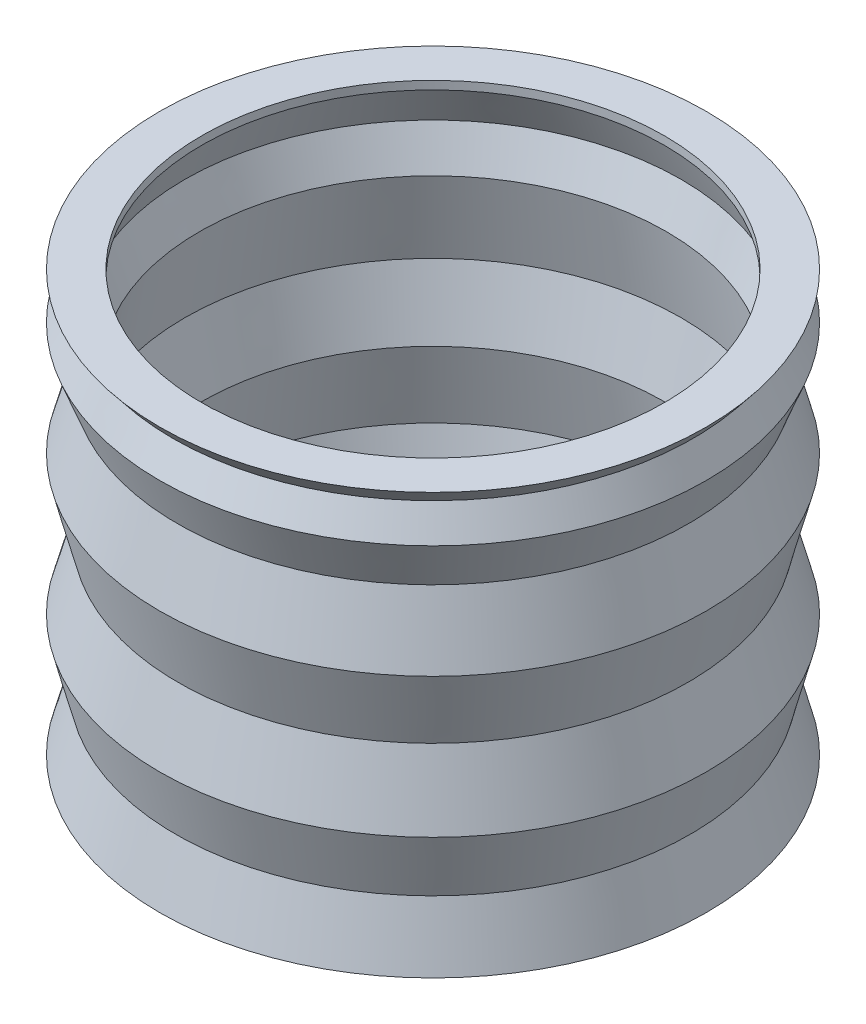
ISO-10303-21;
HEADER;
FILE_DESCRIPTION(('STEP AP214'),'2;1');
FILE_NAME('part.step','',(''),(''),'','','');
FILE_SCHEMA(('AUTOMOTIVE_DESIGN { 1 0 10303 214 1 1 1 1 }'));
ENDSEC;
DATA;
#1=APPLICATION_CONTEXT('core data for automotive mechanical design processes');
#2=APPLICATION_PROTOCOL_DEFINITION('international standard','automotive_design',2000,#1);
#3=PRODUCT_CONTEXT('',#1,'mechanical');
#4=PRODUCT('Part','Part','',(#3));
#5=PRODUCT_RELATED_PRODUCT_CATEGORY('part','',(#4));
#6=PRODUCT_DEFINITION_FORMATION('','',#4);
#7=PRODUCT_DEFINITION_CONTEXT('part definition',#1,'design');
#8=PRODUCT_DEFINITION('design','',#6,#7);
#9=PRODUCT_DEFINITION_SHAPE('','',#8);
#10=(LENGTH_UNIT() NAMED_UNIT(*) SI_UNIT(.MILLI.,.METRE.));
#11=(NAMED_UNIT(*) PLANE_ANGLE_UNIT() SI_UNIT($,.RADIAN.));
#12=(NAMED_UNIT(*) SI_UNIT($,.STERADIAN.) SOLID_ANGLE_UNIT());
#13=UNCERTAINTY_MEASURE_WITH_UNIT(LENGTH_MEASURE(1.E-05),#10,'distance_accuracy_value','');
#14=(GEOMETRIC_REPRESENTATION_CONTEXT(3) GLOBAL_UNCERTAINTY_ASSIGNED_CONTEXT((#13)) GLOBAL_UNIT_ASSIGNED_CONTEXT((#10,
#11,#12)) REPRESENTATION_CONTEXT('',''));
#15=CARTESIAN_POINT('',(0.,0.,0.));
#16=DIRECTION('',(0.,0.,1.));
#17=DIRECTION('',(1.,0.,0.));
#18=AXIS2_PLACEMENT_3D('',#15,#16,#17);
#19=CARTESIAN_POINT('',(0.,0.,0.));
#20=DIRECTION('',(0.,-1.,0.));
#21=DIRECTION('',(0.,0.,-1.));
#22=AXIS2_PLACEMENT_3D('',#19,#20,#21);
#23=CYLINDRICAL_SURFACE('',#22,11.);
#24=CARTESIAN_POINT('',(0.,0.279980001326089,0.));
#25=DIRECTION('',(0.,-1.,0.));
#26=DIRECTION('',(0.,0.,-1.));
#27=AXIS2_PLACEMENT_3D('',#24,#25,#26);
#28=CIRCLE('',#27,11.);
#29=CARTESIAN_POINT('',(0.,0.279980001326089,-11.));
#30=VERTEX_POINT('',#29);
#31=EDGE_CURVE('E10',#30,#30,#28,.T.);
#32=ORIENTED_EDGE('',*,*,#31,.F.);
#33=EDGE_LOOP('',(#32));
#34=FACE_BOUND('',#33,.T.);
#35=CARTESIAN_POINT('',(0.,0.,0.));
#36=DIRECTION('',(0.,-1.,0.));
#37=DIRECTION('',(0.,0.,-1.));
#38=AXIS2_PLACEMENT_3D('',#35,#36,#37);
#39=CIRCLE('',#38,11.);
#40=CARTESIAN_POINT('',(0.,0.,-11.));
#41=VERTEX_POINT('',#40);
#42=EDGE_CURVE('E93',#41,#41,#39,.T.);
#43=ORIENTED_EDGE('',*,*,#42,.T.);
#44=EDGE_LOOP('',(#43));
#45=FACE_BOUND('',#44,.T.);
#46=ADVANCED_FACE('F29',(#34,#45),#23,.F.);
#47=CARTESIAN_POINT('',(0.,0.279980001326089,0.));
#48=DIRECTION('',(0.,1.,0.));
#49=DIRECTION('',(0.,0.,1.));
#50=AXIS2_PLACEMENT_3D('',#47,#48,#49);
#51=CONICAL_SURFACE('',#50,11.,0.853327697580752);
#52=CARTESIAN_POINT('',(0.,0.643060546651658,0.));
#53=DIRECTION('',(0.,-1.,0.));
#54=DIRECTION('',(0.,0.,-1.));
#55=AXIS2_PLACEMENT_3D('',#52,#53,#54);
#56=CIRCLE('',#55,11.416090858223);
#57=CARTESIAN_POINT('',(0.,0.643060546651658,-11.416090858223));
#58=VERTEX_POINT('',#57);
#59=EDGE_CURVE('E35',#58,#58,#56,.T.);
#60=ORIENTED_EDGE('',*,*,#59,.F.);
#61=EDGE_LOOP('',(#60));
#62=FACE_BOUND('',#61,.T.);
#63=ORIENTED_EDGE('',*,*,#31,.T.);
#64=EDGE_LOOP('',(#63));
#65=FACE_BOUND('',#64,.T.);
#66=ADVANCED_FACE('F202',(#62,#65),#51,.F.);
#67=CARTESIAN_POINT('',(0.,0.643060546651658,0.));
#68=DIRECTION('',(0.,-1.,0.));
#69=DIRECTION('',(0.,0.,-1.));
#70=AXIS2_PLACEMENT_3D('',#67,#68,#69);
#71=CONICAL_SURFACE('',#70,11.416090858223,0.176852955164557);
#72=CARTESIAN_POINT('',(0.,2.97123066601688,0.));
#73=DIRECTION('',(0.,-1.,0.));
#74=DIRECTION('',(0.,0.,-1.));
#75=AXIS2_PLACEMENT_3D('',#72,#73,#74);
#76=CIRCLE('',#75,11.);
#77=CARTESIAN_POINT('',(0.,2.97123066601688,-11.));
#78=VERTEX_POINT('',#77);
#79=EDGE_CURVE('E39',#78,#78,#76,.T.);
#80=ORIENTED_EDGE('',*,*,#79,.F.);
#81=EDGE_LOOP('',(#80));
#82=FACE_BOUND('',#81,.T.);
#83=ORIENTED_EDGE('',*,*,#59,.T.);
#84=EDGE_LOOP('',(#83));
#85=FACE_BOUND('',#84,.T.);
#86=ADVANCED_FACE('F197',(#82,#85),#71,.F.);
#87=CARTESIAN_POINT('',(0.,2.97123066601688,0.));
#88=DIRECTION('',(0.,1.,0.));
#89=DIRECTION('',(0.,0.,1.));
#90=AXIS2_PLACEMENT_3D('',#87,#88,#89);
#91=CONICAL_SURFACE('',#90,11.,0.257048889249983);
#92=CARTESIAN_POINT('',(0.,5.43000562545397,0.));
#93=DIRECTION('',(0.,-1.,0.));
#94=DIRECTION('',(0.,0.,-1.));
#95=AXIS2_PLACEMENT_3D('',#92,#93,#94);
#96=CIRCLE('',#95,11.6463235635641);
#97=CARTESIAN_POINT('',(0.,5.43000562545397,-11.6463235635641));
#98=VERTEX_POINT('',#97);
#99=EDGE_CURVE('E43',#98,#98,#96,.T.);
#100=ORIENTED_EDGE('',*,*,#99,.F.);
#101=EDGE_LOOP('',(#100));
#102=FACE_BOUND('',#101,.T.);
#103=ORIENTED_EDGE('',*,*,#79,.T.);
#104=EDGE_LOOP('',(#103));
#105=FACE_BOUND('',#104,.T.);
#106=ADVANCED_FACE('F191',(#102,#105),#91,.F.);
#107=CARTESIAN_POINT('',(0.,5.43000562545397,0.));
#108=DIRECTION('',(0.,-1.,0.));
#109=DIRECTION('',(0.,0.,-1.));
#110=AXIS2_PLACEMENT_3D('',#107,#108,#109);
#111=CONICAL_SURFACE('',#110,11.6463235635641,0.176852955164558);
#112=CARTESIAN_POINT('',(0.,9.0464061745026,0.));
#113=DIRECTION('',(0.,-1.,0.));
#114=DIRECTION('',(0.,0.,-1.));
#115=AXIS2_PLACEMENT_3D('',#112,#113,#114);
#116=CIRCLE('',#115,11.);
#117=CARTESIAN_POINT('',(0.,9.0464061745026,-11.));
#118=VERTEX_POINT('',#117);
#119=EDGE_CURVE('E48',#118,#118,#116,.T.);
#120=ORIENTED_EDGE('',*,*,#119,.F.);
#121=EDGE_LOOP('',(#120));
#122=FACE_BOUND('',#121,.T.);
#123=ORIENTED_EDGE('',*,*,#99,.T.);
#124=EDGE_LOOP('',(#123));
#125=FACE_BOUND('',#124,.T.);
#126=ADVANCED_FACE('F185',(#122,#125),#111,.F.);
#127=CARTESIAN_POINT('',(0.,9.0464061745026,0.));
#128=DIRECTION('',(0.,1.,0.));
#129=DIRECTION('',(0.,0.,1.));
#130=AXIS2_PLACEMENT_3D('',#127,#128,#129);
#131=CONICAL_SURFACE('',#130,11.,0.257048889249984);
#132=CARTESIAN_POINT('',(0.,12.1014382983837,0.));
#133=DIRECTION('',(0.,-1.,0.));
#134=DIRECTION('',(0.,0.,-1.));
#135=AXIS2_PLACEMENT_3D('',#132,#133,#134);
#136=CIRCLE('',#135,11.8030581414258);
#137=CARTESIAN_POINT('',(0.,12.1014382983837,-11.8030581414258));
#138=VERTEX_POINT('',#137);
#139=EDGE_CURVE('E51',#138,#138,#136,.T.);
#140=ORIENTED_EDGE('',*,*,#139,.F.);
#141=EDGE_LOOP('',(#140));
#142=FACE_BOUND('',#141,.T.);
#143=ORIENTED_EDGE('',*,*,#119,.T.);
#144=EDGE_LOOP('',(#143));
#145=FACE_BOUND('',#144,.T.);
#146=ADVANCED_FACE('F179',(#142,#145),#131,.F.);
#147=CARTESIAN_POINT('',(0.,12.1014382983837,0.));
#148=DIRECTION('',(0.,-1.,0.));
#149=DIRECTION('',(0.,0.,-1.));
#150=AXIS2_PLACEMENT_3D('',#147,#148,#149);
#151=CONICAL_SURFACE('',#150,11.8030581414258,0.176852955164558);
#152=CARTESIAN_POINT('',(0.,15.9922148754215,0.));
#153=DIRECTION('',(0.,-1.,0.));
#154=DIRECTION('',(0.,0.,-1.));
#155=AXIS2_PLACEMENT_3D('',#152,#153,#154);
#156=CIRCLE('',#155,11.1076980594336);
#157=CARTESIAN_POINT('',(0.,15.9922148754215,-11.1076980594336));
#158=VERTEX_POINT('',#157);
#159=EDGE_CURVE('E54',#158,#158,#156,.T.);
#160=ORIENTED_EDGE('',*,*,#159,.F.);
#161=EDGE_LOOP('',(#160));
#162=FACE_BOUND('',#161,.T.);
#163=ORIENTED_EDGE('',*,*,#139,.T.);
#164=EDGE_LOOP('',(#163));
#165=FACE_BOUND('',#164,.T.);
#166=ADVANCED_FACE('F173',(#162,#165),#151,.F.);
#167=CARTESIAN_POINT('',(0.,15.9922148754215,0.));
#168=DIRECTION('',(0.,1.,0.));
#169=DIRECTION('',(0.,0.,1.));
#170=AXIS2_PLACEMENT_3D('',#167,#168,#169);
#171=CONICAL_SURFACE('',#170,11.1076980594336,0.36761767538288);
#172=CARTESIAN_POINT('',(0.,17.7977588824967,0.));
#173=DIRECTION('',(0.,-1.,0.));
#174=DIRECTION('',(0.,0.,-1.));
#175=AXIS2_PLACEMENT_3D('',#172,#173,#174);
#176=CIRCLE('',#175,11.8030581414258);
#177=CARTESIAN_POINT('',(0.,17.7977588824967,-11.8030581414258));
#178=VERTEX_POINT('',#177);
#179=EDGE_CURVE('E57',#178,#178,#176,.T.);
#180=ORIENTED_EDGE('',*,*,#179,.F.);
#181=EDGE_LOOP('',(#180));
#182=FACE_BOUND('',#181,.T.);
#183=ORIENTED_EDGE('',*,*,#159,.T.);
#184=EDGE_LOOP('',(#183));
#185=FACE_BOUND('',#184,.T.);
#186=ADVANCED_FACE('F167',(#182,#185),#171,.F.);
#187=CARTESIAN_POINT('',(0.,17.7977588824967,0.));
#188=DIRECTION('',(0.,-1.,0.));
#189=DIRECTION('',(0.,0.,-1.));
#190=AXIS2_PLACEMENT_3D('',#187,#188,#189);
#191=CONICAL_SURFACE('',#190,11.8030581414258,0.417780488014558);
#192=CARTESIAN_POINT('',(0.,19.6068027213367,0.));
#193=DIRECTION('',(0.,-1.,0.));
#194=DIRECTION('',(0.,0.,-1.));
#195=AXIS2_PLACEMENT_3D('',#192,#193,#194);
#196=CIRCLE('',#195,11.);
#197=CARTESIAN_POINT('',(0.,19.6068027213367,-11.));
#198=VERTEX_POINT('',#197);
#199=EDGE_CURVE('E60',#198,#198,#196,.T.);
#200=ORIENTED_EDGE('',*,*,#199,.F.);
#201=EDGE_LOOP('',(#200));
#202=FACE_BOUND('',#201,.T.);
#203=ORIENTED_EDGE('',*,*,#179,.T.);
#204=EDGE_LOOP('',(#203));
#205=FACE_BOUND('',#204,.T.);
#206=ADVANCED_FACE('F161',(#202,#205),#191,.F.);
#207=CARTESIAN_POINT('',(0.,0.,0.));
#208=DIRECTION('',(0.,-1.,0.));
#209=DIRECTION('',(0.,0.,-1.));
#210=AXIS2_PLACEMENT_3D('',#207,#208,#209);
#211=CYLINDRICAL_SURFACE('',#210,11.);
#212=CARTESIAN_POINT('',(0.,20.,0.));
#213=DIRECTION('',(0.,-1.,0.));
#214=DIRECTION('',(0.,0.,-1.));
#215=AXIS2_PLACEMENT_3D('',#212,#213,#214);
#216=CIRCLE('',#215,11.);
#217=CARTESIAN_POINT('',(0.,20.,-11.));
#218=VERTEX_POINT('',#217);
#219=EDGE_CURVE('E63',#218,#218,#216,.T.);
#220=ORIENTED_EDGE('',*,*,#219,.F.);
#221=EDGE_LOOP('',(#220));
#222=FACE_BOUND('',#221,.T.);
#223=ORIENTED_EDGE('',*,*,#199,.T.);
#224=EDGE_LOOP('',(#223));
#225=FACE_BOUND('',#224,.T.);
#226=ADVANCED_FACE('F155',(#222,#225),#211,.F.);
#227=CARTESIAN_POINT('',(-13.,20.,0.));
#228=DIRECTION('',(0.,-1.,0.));
#229=DIRECTION('',(0.,0.,-1.));
#230=AXIS2_PLACEMENT_3D('',#227,#228,#229);
#231=PLANE('',#230);
#232=CARTESIAN_POINT('',(0.,20.,0.));
#233=DIRECTION('',(0.,-1.,0.));
#234=DIRECTION('',(0.,0.,-1.));
#235=AXIS2_PLACEMENT_3D('',#232,#233,#234);
#236=CIRCLE('',#235,13.);
#237=CARTESIAN_POINT('',(0.,20.,-13.));
#238=VERTEX_POINT('',#237);
#239=EDGE_CURVE('E66',#238,#238,#236,.T.);
#240=ORIENTED_EDGE('',*,*,#239,.F.);
#241=EDGE_LOOP('',(#240));
#242=FACE_BOUND('',#241,.T.);
#243=ORIENTED_EDGE('',*,*,#219,.T.);
#244=EDGE_LOOP('',(#243));
#245=FACE_BOUND('',#244,.T.);
#246=ADVANCED_FACE('F149',(#242,#245),#231,.F.);
#247=CARTESIAN_POINT('',(0.,20.,0.));
#248=DIRECTION('',(0.,1.,0.));
#249=DIRECTION('',(0.,0.,1.));
#250=AXIS2_PLACEMENT_3D('',#247,#248,#249);
#251=CONICAL_SURFACE('',#250,13.,0.674273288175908);
#252=CARTESIAN_POINT('',(0.,19.2136054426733,0.));
#253=DIRECTION('',(0.,-1.,0.));
#254=DIRECTION('',(0.,0.,-1.));
#255=AXIS2_PLACEMENT_3D('',#252,#253,#254);
#256=CIRCLE('',#255,12.3714872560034);
#257=CARTESIAN_POINT('',(0.,19.2136054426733,-12.3714872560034));
#258=VERTEX_POINT('',#257);
#259=EDGE_CURVE('E69',#258,#258,#256,.T.);
#260=ORIENTED_EDGE('',*,*,#259,.F.);
#261=EDGE_LOOP('',(#260));
#262=FACE_BOUND('',#261,.T.);
#263=ORIENTED_EDGE('',*,*,#239,.T.);
#264=EDGE_LOOP('',(#263));
#265=FACE_BOUND('',#264,.T.);
#266=ADVANCED_FACE('F143',(#262,#265),#251,.T.);
#267=CARTESIAN_POINT('',(0.,19.2136054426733,0.));
#268=DIRECTION('',(0.,-1.,0.));
#269=DIRECTION('',(0.,0.,-1.));
#270=AXIS2_PLACEMENT_3D('',#267,#268,#269);
#271=CONICAL_SURFACE('',#270,12.3714872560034,0.417780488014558);
#272=CARTESIAN_POINT('',(0.,17.7977588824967,0.));
#273=DIRECTION('',(0.,-1.,0.));
#274=DIRECTION('',(0.,0.,-1.));
#275=AXIS2_PLACEMENT_3D('',#272,#273,#274);
#276=CIRCLE('',#275,13.);
#277=CARTESIAN_POINT('',(0.,17.7977588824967,-13.));
#278=VERTEX_POINT('',#277);
#279=EDGE_CURVE('E72',#278,#278,#276,.T.);
#280=ORIENTED_EDGE('',*,*,#279,.F.);
#281=EDGE_LOOP('',(#280));
#282=FACE_BOUND('',#281,.T.);
#283=ORIENTED_EDGE('',*,*,#259,.T.);
#284=EDGE_LOOP('',(#283));
#285=FACE_BOUND('',#284,.T.);
#286=ADVANCED_FACE('F137',(#282,#285),#271,.T.);
#287=CARTESIAN_POINT('',(0.,17.7977588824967,0.));
#288=DIRECTION('',(0.,1.,0.));
#289=DIRECTION('',(0.,0.,1.));
#290=AXIS2_PLACEMENT_3D('',#287,#288,#289);
#291=CONICAL_SURFACE('',#290,13.,0.36761767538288);
#292=CARTESIAN_POINT('',(0.,15.5907834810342,0.));
#293=DIRECTION('',(0.,-1.,0.));
#294=DIRECTION('',(0.,0.,-1.));
#295=AXIS2_PLACEMENT_3D('',#292,#293,#294);
#296=CIRCLE('',#295,12.1500386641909);
#297=CARTESIAN_POINT('',(0.,15.5907834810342,-12.1500386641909));
#298=VERTEX_POINT('',#297);
#299=EDGE_CURVE('E75',#298,#298,#296,.T.);
#300=ORIENTED_EDGE('',*,*,#299,.F.);
#301=EDGE_LOOP('',(#300));
#302=FACE_BOUND('',#301,.T.);
#303=ORIENTED_EDGE('',*,*,#279,.T.);
#304=EDGE_LOOP('',(#303));
#305=FACE_BOUND('',#304,.T.);
#306=ADVANCED_FACE('F131',(#302,#305),#291,.T.);
#307=CARTESIAN_POINT('',(0.,15.5907834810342,0.));
#308=DIRECTION('',(0.,-1.,0.));
#309=DIRECTION('',(0.,0.,-1.));
#310=AXIS2_PLACEMENT_3D('',#307,#308,#309);
#311=CONICAL_SURFACE('',#310,12.1500386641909,0.26210430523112);
#312=CARTESIAN_POINT('',(0.,12.4225491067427,0.));
#313=DIRECTION('',(0.,-1.,0.));
#314=DIRECTION('',(0.,0.,-1.));
#315=AXIS2_PLACEMENT_3D('',#312,#313,#314);
#316=CIRCLE('',#315,13.);
#317=CARTESIAN_POINT('',(0.,12.4225491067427,-13.));
#318=VERTEX_POINT('',#317);
#319=EDGE_CURVE('E78',#318,#318,#316,.T.);
#320=ORIENTED_EDGE('',*,*,#319,.F.);
#321=EDGE_LOOP('',(#320));
#322=FACE_BOUND('',#321,.T.);
#323=ORIENTED_EDGE('',*,*,#299,.T.);
#324=EDGE_LOOP('',(#323));
#325=FACE_BOUND('',#324,.T.);
#326=ADVANCED_FACE('F125',(#322,#325),#311,.T.);
#327=CARTESIAN_POINT('',(0.,12.4225491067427,0.));
#328=DIRECTION('',(0.,1.,0.));
#329=DIRECTION('',(0.,0.,1.));
#330=AXIS2_PLACEMENT_3D('',#327,#328,#329);
#331=CONICAL_SURFACE('',#330,13.,0.252971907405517);
#332=CARTESIAN_POINT('',(0.,9.0464061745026,0.));
#333=DIRECTION('',(0.,-1.,0.));
#334=DIRECTION('',(0.,0.,-1.));
#335=AXIS2_PLACEMENT_3D('',#332,#333,#334);
#336=CIRCLE('',#335,12.12723326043);
#337=CARTESIAN_POINT('',(0.,9.0464061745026,-12.12723326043));
#338=VERTEX_POINT('',#337);
#339=EDGE_CURVE('E81',#338,#338,#336,.T.);
#340=ORIENTED_EDGE('',*,*,#339,.F.);
#341=EDGE_LOOP('',(#340));
#342=FACE_BOUND('',#341,.T.);
#343=ORIENTED_EDGE('',*,*,#319,.T.);
#344=EDGE_LOOP('',(#343));
#345=FACE_BOUND('',#344,.T.);
#346=ADVANCED_FACE('F119',(#342,#345),#331,.T.);
#347=CARTESIAN_POINT('',(0.,9.0464061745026,0.));
#348=DIRECTION('',(0.,-1.,0.));
#349=DIRECTION('',(0.,0.,-1.));
#350=AXIS2_PLACEMENT_3D('',#347,#348,#349);
#351=CONICAL_SURFACE('',#350,12.12723326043,0.26210430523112);
#352=CARTESIAN_POINT('',(0.,5.79316456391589,0.));
#353=DIRECTION('',(0.,-1.,0.));
#354=DIRECTION('',(0.,0.,-1.));
#355=AXIS2_PLACEMENT_3D('',#352,#353,#354);
#356=CIRCLE('',#355,13.);
#357=CARTESIAN_POINT('',(0.,5.79316456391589,-13.));
#358=VERTEX_POINT('',#357);
#359=EDGE_CURVE('E84',#358,#358,#356,.T.);
#360=ORIENTED_EDGE('',*,*,#359,.F.);
#361=EDGE_LOOP('',(#360));
#362=FACE_BOUND('',#361,.T.);
#363=ORIENTED_EDGE('',*,*,#339,.T.);
#364=EDGE_LOOP('',(#363));
#365=FACE_BOUND('',#364,.T.);
#366=ADVANCED_FACE('F113',(#362,#365),#351,.T.);
#367=CARTESIAN_POINT('',(0.,5.79316456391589,0.));
#368=DIRECTION('',(0.,1.,0.));
#369=DIRECTION('',(0.,0.,1.));
#370=AXIS2_PLACEMENT_3D('',#367,#368,#369);
#371=CONICAL_SURFACE('',#370,13.,0.252971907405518);
#372=CARTESIAN_POINT('',(0.,2.84288290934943,0.));
#373=DIRECTION('',(0.,-1.,0.));
#374=DIRECTION('',(0.,0.,-1.));
#375=AXIS2_PLACEMENT_3D('',#372,#373,#374);
#376=CIRCLE('',#375,12.2373226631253);
#377=CARTESIAN_POINT('',(0.,2.84288290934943,-12.2373226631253));
#378=VERTEX_POINT('',#377);
#379=EDGE_CURVE('E87',#378,#378,#376,.T.);
#380=ORIENTED_EDGE('',*,*,#379,.F.);
#381=EDGE_LOOP('',(#380));
#382=FACE_BOUND('',#381,.T.);
#383=ORIENTED_EDGE('',*,*,#359,.T.);
#384=EDGE_LOOP('',(#383));
#385=FACE_BOUND('',#384,.T.);
#386=ADVANCED_FACE('F107',(#382,#385),#371,.T.);
#387=CARTESIAN_POINT('',(0.,2.84288290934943,0.));
#388=DIRECTION('',(0.,-1.,0.));
#389=DIRECTION('',(0.,0.,-1.));
#390=AXIS2_PLACEMENT_3D('',#387,#388,#389);
#391=CONICAL_SURFACE('',#390,12.2373226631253,0.26210430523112);
#392=CARTESIAN_POINT('',(0.,0.,0.));
#393=DIRECTION('',(0.,-1.,0.));
#394=DIRECTION('',(0.,0.,-1.));
#395=AXIS2_PLACEMENT_3D('',#392,#393,#394);
#396=CIRCLE('',#395,13.);
#397=CARTESIAN_POINT('',(0.,0.,-13.));
#398=VERTEX_POINT('',#397);
#399=EDGE_CURVE('E90',#398,#398,#396,.T.);
#400=ORIENTED_EDGE('',*,*,#399,.F.);
#401=EDGE_LOOP('',(#400));
#402=FACE_BOUND('',#401,.T.);
#403=ORIENTED_EDGE('',*,*,#379,.T.);
#404=EDGE_LOOP('',(#403));
#405=FACE_BOUND('',#404,.T.);
#406=ADVANCED_FACE('F101',(#402,#405),#391,.T.);
#407=CARTESIAN_POINT('',(-11.,0.,0.));
#408=DIRECTION('',(0.,1.,0.));
#409=DIRECTION('',(0.,0.,1.));
#410=AXIS2_PLACEMENT_3D('',#407,#408,#409);
#411=PLANE('',#410);
#412=ORIENTED_EDGE('',*,*,#42,.F.);
#413=EDGE_LOOP('',(#412));
#414=FACE_BOUND('',#413,.T.);
#415=ORIENTED_EDGE('',*,*,#399,.T.);
#416=EDGE_LOOP('',(#415));
#417=FACE_BOUND('',#416,.T.);
#418=ADVANCED_FACE('F98',(#414,#417),#411,.F.);
#419=CLOSED_SHELL('',(#46,#66,#86,#106,#126,#146,#166,#186,#206,#226,#246,#266,#286,#306,#326,
#346,#366,#386,#406,#418));
#420=MANIFOLD_SOLID_BREP('B2',#419);
#421=ADVANCED_BREP_SHAPE_REPRESENTATION('',(#18,#420),#14);
#422=SHAPE_DEFINITION_REPRESENTATION(#9,#421);
ENDSEC;
END-ISO-10303-21;
